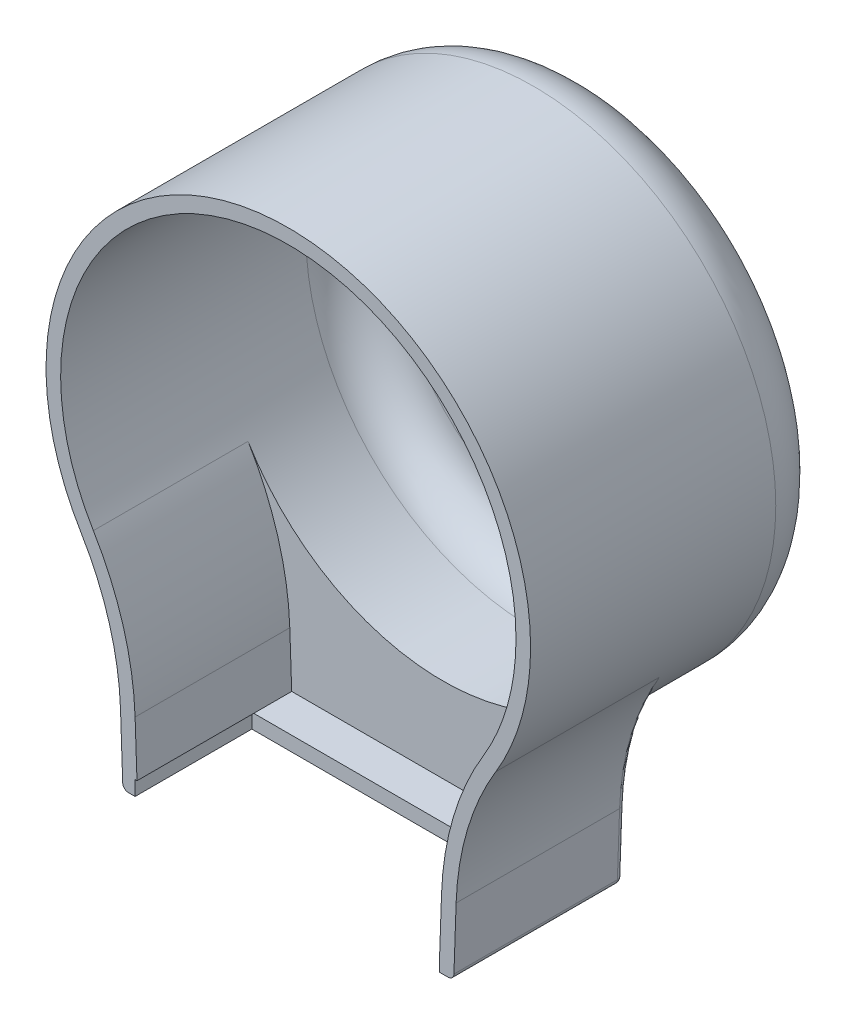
ISO-10303-21;
HEADER;
FILE_DESCRIPTION(('STEP AP214'),'2;1');
FILE_NAME('part.step','',(''),(''),'','','');
FILE_SCHEMA(('AUTOMOTIVE_DESIGN { 1 0 10303 214 1 1 1 1 }'));
ENDSEC;
DATA;
#1=APPLICATION_CONTEXT('core data for automotive mechanical design processes');
#2=APPLICATION_PROTOCOL_DEFINITION('international standard','automotive_design',2000,#1);
#3=PRODUCT_CONTEXT('',#1,'mechanical');
#4=PRODUCT('Part','Part','',(#3));
#5=PRODUCT_RELATED_PRODUCT_CATEGORY('part','',(#4));
#6=PRODUCT_DEFINITION_FORMATION('','',#4);
#7=PRODUCT_DEFINITION_CONTEXT('part definition',#1,'design');
#8=PRODUCT_DEFINITION('design','',#6,#7);
#9=PRODUCT_DEFINITION_SHAPE('','',#8);
#10=(LENGTH_UNIT() NAMED_UNIT(*) SI_UNIT(.MILLI.,.METRE.));
#11=(NAMED_UNIT(*) PLANE_ANGLE_UNIT() SI_UNIT($,.RADIAN.));
#12=(NAMED_UNIT(*) SI_UNIT($,.STERADIAN.) SOLID_ANGLE_UNIT());
#13=UNCERTAINTY_MEASURE_WITH_UNIT(LENGTH_MEASURE(1.E-05),#10,'distance_accuracy_value','');
#14=(GEOMETRIC_REPRESENTATION_CONTEXT(3) GLOBAL_UNCERTAINTY_ASSIGNED_CONTEXT((#13)) GLOBAL_UNIT_ASSIGNED_CONTEXT((#10,
#11,#12)) REPRESENTATION_CONTEXT('',''));
#15=CARTESIAN_POINT('',(0.,0.,0.));
#16=DIRECTION('',(0.,0.,1.));
#17=DIRECTION('',(1.,0.,0.));
#18=AXIS2_PLACEMENT_3D('',#15,#16,#17);
#19=CARTESIAN_POINT('',(-28.7432182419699,-44.3029433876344,-48.));
#20=DIRECTION('',(-0.999390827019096,-0.034899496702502,0.));
#21=DIRECTION('',(0.034899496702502,-0.999390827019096,0.));
#22=AXIS2_PLACEMENT_3D('',#19,#20,#21);
#23=PLANE('',#22);
#24=DIRECTION('',(0.,0.,1.));
#25=VECTOR('',#24,1.);
#26=CARTESIAN_POINT('',(-28.7432182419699,-44.3029433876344,-48.));
#27=LINE('',#26,#25);
#28=CARTESIAN_POINT('',(-28.7432182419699,-44.3029433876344,-24.));
#29=VERTEX_POINT('',#28);
#30=CARTESIAN_POINT('',(-28.7432182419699,-44.3029433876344,4.));
#31=VERTEX_POINT('',#30);
#32=EDGE_CURVE('E286',#29,#31,#27,.T.);
#33=ORIENTED_EDGE('',*,*,#32,.F.);
#34=DIRECTION('',(-0.034899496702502,0.999390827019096,0.));
#35=VECTOR('',#34,1.);
#36=CARTESIAN_POINT('',(-28.7432182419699,-44.3029433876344,-24.));
#37=LINE('',#36,#35);
#38=CARTESIAN_POINT('',(-28.3684500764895,-55.0348994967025,-24.));
#39=VERTEX_POINT('',#38);
#40=EDGE_CURVE('E56',#29,#39,#37,.F.);
#41=ORIENTED_EDGE('',*,*,#40,.T.);
#42=DIRECTION('',(0.,0.,1.));
#43=VECTOR('',#42,1.);
#44=CARTESIAN_POINT('',(-28.3684500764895,-55.0348994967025,-48.));
#45=LINE('',#44,#43);
#46=CARTESIAN_POINT('',(-28.3684500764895,-55.0348994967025,4.));
#47=VERTEX_POINT('',#46);
#48=EDGE_CURVE('E328',#39,#47,#45,.T.);
#49=ORIENTED_EDGE('',*,*,#48,.T.);
#50=DIRECTION('',(0.034899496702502,-0.999390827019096,0.));
#51=VECTOR('',#50,1.);
#52=CARTESIAN_POINT('',(-28.7432182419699,-44.3029433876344,4.));
#53=LINE('',#52,#51);
#54=EDGE_CURVE('E269',#31,#47,#53,.T.);
#55=ORIENTED_EDGE('',*,*,#54,.F.);
#56=EDGE_LOOP('',(#33,#41,#49,#55));
#57=FACE_BOUND('',#56,.T.);
#58=ADVANCED_FACE('F36',(#57),#23,.T.);
#59=CARTESIAN_POINT('',(-76.2142825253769,-45.9606694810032,-48.));
#60=DIRECTION('',(0.,0.,1.));
#61=DIRECTION('',(1.,0.,0.));
#62=AXIS2_PLACEMENT_3D('',#59,#60,#61);
#63=CYLINDRICAL_SURFACE('',#62,47.5);
#64=DIRECTION('',(0.,0.,1.));
#65=VECTOR('',#64,1.);
#66=CARTESIAN_POINT('',(-35.5381205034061,-21.4310986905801,-48.));
#67=LINE('',#66,#65);
#68=CARTESIAN_POINT('',(-35.5381205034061,-21.4310986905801,-24.));
#69=VERTEX_POINT('',#68);
#70=CARTESIAN_POINT('',(-35.5381205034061,-21.4310986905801,4.));
#71=VERTEX_POINT('',#70);
#72=EDGE_CURVE('E289',#69,#71,#67,.T.);
#73=ORIENTED_EDGE('',*,*,#72,.F.);
#74=CARTESIAN_POINT('',(-76.2142825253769,-45.9606694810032,-24.));
#75=DIRECTION('',(0.,0.,-1.));
#76=DIRECTION('',(-1.,0.,0.));
#77=AXIS2_PLACEMENT_3D('',#74,#75,#76);
#78=CIRCLE('',#77,47.5);
#79=EDGE_CURVE('E64',#69,#29,#78,.T.);
#80=ORIENTED_EDGE('',*,*,#79,.T.);
#81=ORIENTED_EDGE('',*,*,#32,.T.);
#82=CARTESIAN_POINT('',(-76.2142825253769,-45.9606694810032,4.));
#83=DIRECTION('',(0.,0.,-1.));
#84=DIRECTION('',(1.,0.,0.));
#85=AXIS2_PLACEMENT_3D('',#82,#83,#84);
#86=CIRCLE('',#85,47.5);
#87=EDGE_CURVE('E282',#71,#31,#86,.T.);
#88=ORIENTED_EDGE('',*,*,#87,.F.);
#89=EDGE_LOOP('',(#73,#80,#81,#88));
#90=FACE_BOUND('',#89,.T.);
#91=ADVANCED_FACE('F437',(#90),#63,.F.);
#92=CARTESIAN_POINT('',(76.2142825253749,-45.9606694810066,-48.));
#93=DIRECTION('',(0.,0.,1.));
#94=DIRECTION('',(1.,0.,0.));
#95=AXIS2_PLACEMENT_3D('',#92,#93,#94);
#96=CYLINDRICAL_SURFACE('',#95,47.5);
#97=DIRECTION('',(0.,0.,1.));
#98=VECTOR('',#97,1.);
#99=CARTESIAN_POINT('',(28.7432182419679,-44.3029433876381,-48.));
#100=LINE('',#99,#98);
#101=CARTESIAN_POINT('',(28.7432182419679,-44.3029433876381,-24.));
#102=VERTEX_POINT('',#101);
#103=CARTESIAN_POINT('',(28.7432182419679,-44.3029433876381,4.));
#104=VERTEX_POINT('',#103);
#105=EDGE_CURVE('E285',#102,#104,#100,.T.);
#106=ORIENTED_EDGE('',*,*,#105,.F.);
#107=CARTESIAN_POINT('',(76.2142825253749,-45.9606694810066,-24.));
#108=DIRECTION('',(0.,0.,-1.));
#109=DIRECTION('',(-1.,0.,0.));
#110=AXIS2_PLACEMENT_3D('',#107,#108,#109);
#111=CIRCLE('',#110,47.5);
#112=CARTESIAN_POINT('',(35.5381205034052,-21.4310986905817,-24.));
#113=VERTEX_POINT('',#112);
#114=EDGE_CURVE('E311',#102,#113,#111,.T.);
#115=ORIENTED_EDGE('',*,*,#114,.T.);
#116=DIRECTION('',(0.,0.,1.));
#117=VECTOR('',#116,1.);
#118=CARTESIAN_POINT('',(35.5381205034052,-21.4310986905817,-48.));
#119=LINE('',#118,#117);
#120=CARTESIAN_POINT('',(35.5381205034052,-21.4310986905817,4.));
#121=VERTEX_POINT('',#120);
#122=EDGE_CURVE('E291',#113,#121,#119,.T.);
#123=ORIENTED_EDGE('',*,*,#122,.T.);
#124=CARTESIAN_POINT('',(76.2142825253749,-45.9606694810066,4.));
#125=DIRECTION('',(0.,0.,-1.));
#126=DIRECTION('',(1.,0.,0.));
#127=AXIS2_PLACEMENT_3D('',#124,#125,#126);
#128=CIRCLE('',#127,47.5);
#129=EDGE_CURVE('E276',#104,#121,#128,.T.);
#130=ORIENTED_EDGE('',*,*,#129,.F.);
#131=EDGE_LOOP('',(#106,#115,#123,#130));
#132=FACE_BOUND('',#131,.T.);
#133=ADVANCED_FACE('F439',(#132),#96,.F.);
#134=CARTESIAN_POINT('',(28.3347480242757,-56.,-48.));
#135=DIRECTION('',(0.999390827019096,-0.0348994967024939,0.));
#136=DIRECTION('',(0.0348994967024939,0.999390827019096,0.));
#137=AXIS2_PLACEMENT_3D('',#134,#135,#136);
#138=PLANE('',#137);
#139=DIRECTION('',(0.,0.,1.));
#140=VECTOR('',#139,1.);
#141=CARTESIAN_POINT('',(28.3684500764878,-55.0348994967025,-48.));
#142=LINE('',#141,#140);
#143=CARTESIAN_POINT('',(28.3684500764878,-55.0348994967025,4.));
#144=VERTEX_POINT('',#143);
#145=CARTESIAN_POINT('',(28.3684500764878,-55.0348994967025,-24.));
#146=VERTEX_POINT('',#145);
#147=EDGE_CURVE('E313',#144,#146,#142,.F.);
#148=ORIENTED_EDGE('',*,*,#147,.T.);
#149=DIRECTION('',(-0.0348994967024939,-0.999390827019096,0.));
#150=VECTOR('',#149,1.);
#151=CARTESIAN_POINT('',(28.3347480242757,-56.,-24.));
#152=LINE('',#151,#150);
#153=EDGE_CURVE('E315',#146,#102,#152,.F.);
#154=ORIENTED_EDGE('',*,*,#153,.T.);
#155=ORIENTED_EDGE('',*,*,#105,.T.);
#156=DIRECTION('',(0.0348994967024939,0.999390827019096,0.));
#157=VECTOR('',#156,1.);
#158=CARTESIAN_POINT('',(28.3347480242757,-56.,4.));
#159=LINE('',#158,#157);
#160=EDGE_CURVE('E274',#144,#104,#159,.T.);
#161=ORIENTED_EDGE('',*,*,#160,.F.);
#162=EDGE_LOOP('',(#148,#154,#155,#161));
#163=FACE_BOUND('',#162,.T.);
#164=ADVANCED_FACE('F444',(#163),#138,.T.);
#165=CARTESIAN_POINT('',(-28.3347480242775,-56.,-48.));
#166=DIRECTION('',(0.,-1.,0.));
#167=DIRECTION('',(1.,0.,0.));
#168=AXIS2_PLACEMENT_3D('',#165,#166,#167);
#169=PLANE('',#168);
#170=DIRECTION('',(-1.,0.,0.));
#171=VECTOR('',#170,1.);
#172=CARTESIAN_POINT('',(-28.3347480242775,-56.,-24.));
#173=LINE('',#172,#171);
#174=CARTESIAN_POINT('',(-27.3690592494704,-56.,-24.));
#175=VERTEX_POINT('',#174);
#176=CARTESIAN_POINT('',(27.3690592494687,-56.,-24.));
#177=VERTEX_POINT('',#176);
#178=EDGE_CURVE('E319',#175,#177,#173,.F.);
#179=ORIENTED_EDGE('',*,*,#178,.T.);
#180=DIRECTION('',(0.,0.,1.));
#181=VECTOR('',#180,1.);
#182=CARTESIAN_POINT('',(27.3690592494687,-56.,-48.));
#183=LINE('',#182,#181);
#184=CARTESIAN_POINT('',(27.3690592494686,-56.,4.));
#185=VERTEX_POINT('',#184);
#186=EDGE_CURVE('E321',#177,#185,#183,.T.);
#187=ORIENTED_EDGE('',*,*,#186,.T.);
#188=DIRECTION('',(1.,0.,0.));
#189=VECTOR('',#188,1.);
#190=CARTESIAN_POINT('',(-28.3347480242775,-56.,4.));
#191=LINE('',#190,#189);
#192=CARTESIAN_POINT('',(25.920526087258,-56.,3.99999999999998));
#193=VERTEX_POINT('',#192);
#194=EDGE_CURVE('E272',#193,#185,#191,.T.);
#195=ORIENTED_EDGE('',*,*,#194,.F.);
#196=DIRECTION('',(0.,0.,-1.));
#197=VECTOR('',#196,1.);
#198=CARTESIAN_POINT('',(25.920526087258,-56.,3.99999999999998));
#199=LINE('',#198,#197);
#200=CARTESIAN_POINT('',(25.920526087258,-56.,-16.));
#201=VERTEX_POINT('',#200);
#202=EDGE_CURVE('E216',#193,#201,#199,.T.);
#203=ORIENTED_EDGE('',*,*,#202,.T.);
#204=DIRECTION('',(-1.,0.,0.));
#205=VECTOR('',#204,1.);
#206=CARTESIAN_POINT('',(-26.2447411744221,-56.,-16.));
#207=LINE('',#206,#205);
#208=CARTESIAN_POINT('',(-26.2447411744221,-56.,-16.));
#209=VERTEX_POINT('',#208);
#210=EDGE_CURVE('E211',#201,#209,#207,.T.);
#211=ORIENTED_EDGE('',*,*,#210,.T.);
#212=DIRECTION('',(0.,0.,1.));
#213=VECTOR('',#212,1.);
#214=CARTESIAN_POINT('',(-26.2447411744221,-56.,3.99999999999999));
#215=LINE('',#214,#213);
#216=CARTESIAN_POINT('',(-26.2447411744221,-56.,3.99999999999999));
#217=VERTEX_POINT('',#216);
#218=EDGE_CURVE('E478',#209,#217,#215,.T.);
#219=ORIENTED_EDGE('',*,*,#218,.T.);
#220=CARTESIAN_POINT('',(-27.3690592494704,-56.,4.));
#221=VERTEX_POINT('',#220);
#222=EDGE_CURVE('E209',#221,#217,#191,.T.);
#223=ORIENTED_EDGE('',*,*,#222,.F.);
#224=DIRECTION('',(0.,0.,1.));
#225=VECTOR('',#224,1.);
#226=CARTESIAN_POINT('',(-27.3690592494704,-56.,-48.));
#227=LINE('',#226,#225);
#228=EDGE_CURVE('E317',#221,#175,#227,.F.);
#229=ORIENTED_EDGE('',*,*,#228,.T.);
#230=EDGE_LOOP('',(#179,#187,#195,#203,#211,#219,#223,#229));
#231=FACE_BOUND('',#230,.T.);
#232=ADVANCED_FACE('F506',(#231),#169,.T.);
#233=CARTESIAN_POINT('',(0.,0.,-48.));
#234=DIRECTION('',(0.,0.,1.));
#235=DIRECTION('',(1.,0.,0.));
#236=AXIS2_PLACEMENT_3D('',#233,#234,#235);
#237=CYLINDRICAL_SURFACE('',#236,41.5);
#238=CARTESIAN_POINT('',(0.,0.,-38.));
#239=DIRECTION('',(0.,0.,1.));
#240=DIRECTION('',(1.,0.,0.));
#241=AXIS2_PLACEMENT_3D('',#238,#239,#240);
#242=CIRCLE('',#241,41.5);
#243=CARTESIAN_POINT('',(41.5,0.,-38.));
#244=VERTEX_POINT('',#243);
#245=EDGE_CURVE('E288',#244,#244,#242,.T.);
#246=ORIENTED_EDGE('',*,*,#245,.T.);
#247=EDGE_LOOP('',(#246));
#248=FACE_BOUND('',#247,.T.);
#249=CARTESIAN_POINT('',(0.,0.,-25.));
#250=DIRECTION('',(0.,0.,1.));
#251=DIRECTION('',(-1.,0.,0.));
#252=AXIS2_PLACEMENT_3D('',#249,#250,#251);
#253=CIRCLE('',#252,41.5);
#254=CARTESIAN_POINT('',(-31.6324148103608,-26.8633641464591,-25.));
#255=VERTEX_POINT('',#254);
#256=CARTESIAN_POINT('',(31.6324148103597,-26.8633641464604,-25.));
#257=VERTEX_POINT('',#256);
#258=EDGE_CURVE('E254',#255,#257,#253,.T.);
#259=ORIENTED_EDGE('',*,*,#258,.F.);
#260=CARTESIAN_POINT('',(-31.6324148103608,-26.8633641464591,-25.));
#261=CARTESIAN_POINT('',(-31.6866088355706,-26.7995491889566,-24.9999961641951));
#262=CARTESIAN_POINT('',(-31.740606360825,-26.7355739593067,-24.9990861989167));
#263=CARTESIAN_POINT('',(-31.8481874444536,-26.6073290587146,-24.9956166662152));
#264=CARTESIAN_POINT('',(-31.9017710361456,-26.5430594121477,-24.9930572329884));
#265=CARTESIAN_POINT('',(-32.0618342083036,-26.3498908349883,-24.9831514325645));
#266=CARTESIAN_POINT('',(-32.1676753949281,-26.220574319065,-24.97357726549));
#267=CARTESIAN_POINT('',(-32.3773658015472,-25.9612008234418,-24.9495248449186));
#268=CARTESIAN_POINT('',(-32.4812183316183,-25.8311456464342,-24.9350556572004));
#269=CARTESIAN_POINT('',(-32.6871132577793,-25.5701049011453,-24.9019976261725));
#270=CARTESIAN_POINT('',(-32.789155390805,-25.4391192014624,-24.8834081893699));
#271=CARTESIAN_POINT('',(-33.0099392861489,-25.1521850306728,-24.839038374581));
#272=CARTESIAN_POINT('',(-33.1283137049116,-24.9960617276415,-24.8125644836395));
#273=CARTESIAN_POINT('',(-33.3625028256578,-24.6826189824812,-24.7556530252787));
#274=CARTESIAN_POINT('',(-33.4783173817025,-24.5252994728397,-24.7252152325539));
#275=CARTESIAN_POINT('',(-33.8219971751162,-24.0515032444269,-24.6290943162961));
#276=CARTESIAN_POINT('',(-34.0460615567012,-23.7332369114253,-24.55861158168));
#277=CARTESIAN_POINT('',(-34.4845121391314,-23.0915478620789,-24.409725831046));
#278=CARTESIAN_POINT('',(-34.6988892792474,-22.7681206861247,-24.3313156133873));
#279=CARTESIAN_POINT('',(-35.1180868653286,-22.1160618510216,-24.1706782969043));
#280=CARTESIAN_POINT('',(-35.3229073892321,-21.7874302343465,-24.0884512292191));
#281=CARTESIAN_POINT('',(-35.5280940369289,-21.4477184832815,-24.0041242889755));
#282=CARTESIAN_POINT('',(-35.5331087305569,-21.4394094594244,-24.0020621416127));
#283=CARTESIAN_POINT('',(-35.5381205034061,-21.4310986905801,-24.));
#284=B_SPLINE_CURVE_WITH_KNOTS('',3,(#260,#261,#262,#263,#264,#265,#266,#267,#268,#269,#270,
#271,#272,#273,#274,#275,#276,#277,#278,#279,#280,#281,#282,#283),.UNSPECIFIED.,.F.,.F.,(4,2,2,
2,2,2,2,2,2,2,2,4),(0.,0.251152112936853,0.502283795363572,1.00431924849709,1.50542995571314,
2.00661289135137,2.59965983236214,3.1927404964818,4.37908518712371,5.56651745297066,
6.75394003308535,6.78370503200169),.UNSPECIFIED.);
#285=EDGE_CURVE('E11',#255,#69,#284,.T.);
#286=ORIENTED_EDGE('',*,*,#285,.T.);
#287=ORIENTED_EDGE('',*,*,#72,.T.);
#288=CARTESIAN_POINT('',(0.,0.,4.));
#289=DIRECTION('',(0.,0.,1.));
#290=DIRECTION('',(1.,0.,0.));
#291=AXIS2_PLACEMENT_3D('',#288,#289,#290);
#292=CIRCLE('',#291,41.5);
#293=EDGE_CURVE('E279',#121,#71,#292,.T.);
#294=ORIENTED_EDGE('',*,*,#293,.F.);
#295=ORIENTED_EDGE('',*,*,#122,.F.);
#296=CARTESIAN_POINT('',(31.6324148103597,-26.8633641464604,-25.));
#297=CARTESIAN_POINT('',(31.6866088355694,-26.7995491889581,-24.9999961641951));
#298=CARTESIAN_POINT('',(31.7406063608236,-26.7355739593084,-24.9990861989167));
#299=CARTESIAN_POINT('',(31.8481874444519,-26.6073290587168,-24.9956166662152));
#300=CARTESIAN_POINT('',(31.9017710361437,-26.5430594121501,-24.9930572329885));
#301=CARTESIAN_POINT('',(32.0618342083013,-26.3498908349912,-24.9831514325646));
#302=CARTESIAN_POINT('',(32.1676753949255,-26.2205743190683,-24.9735772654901));
#303=CARTESIAN_POINT('',(32.3773658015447,-25.9612008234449,-24.9495248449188));
#304=CARTESIAN_POINT('',(32.4812183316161,-25.8311456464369,-24.9350556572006));
#305=CARTESIAN_POINT('',(32.6871132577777,-25.5701049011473,-24.9019976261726));
#306=CARTESIAN_POINT('',(32.7891553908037,-25.4391192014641,-24.88340818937));
#307=CARTESIAN_POINT('',(33.0099392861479,-25.1521850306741,-24.839038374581));
#308=CARTESIAN_POINT('',(33.1283137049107,-24.9960617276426,-24.8125644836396));
#309=CARTESIAN_POINT('',(33.362502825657,-24.6826189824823,-24.7556530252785));
#310=CARTESIAN_POINT('',(33.4783173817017,-24.5252994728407,-24.7252152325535));
#311=CARTESIAN_POINT('',(33.8219971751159,-24.0515032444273,-24.6290943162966));
#312=CARTESIAN_POINT('',(34.0460615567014,-23.7332369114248,-24.558611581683));
#313=CARTESIAN_POINT('',(34.484512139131,-23.0915478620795,-24.4097258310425));
#314=CARTESIAN_POINT('',(34.6988892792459,-22.7681206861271,-24.3313156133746));
#315=CARTESIAN_POINT('',(35.1180868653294,-22.1160618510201,-24.1706782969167));
#316=CARTESIAN_POINT('',(35.3229073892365,-21.7874302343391,-24.0884512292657));
#317=CARTESIAN_POINT('',(35.5280940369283,-21.4477184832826,-24.0041242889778));
#318=CARTESIAN_POINT('',(35.5331087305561,-21.4394094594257,-24.0020621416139));
#319=CARTESIAN_POINT('',(35.5381205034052,-21.4310986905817,-24.));
#320=B_SPLINE_CURVE_WITH_KNOTS('',3,(#296,#297,#298,#299,#300,#301,#302,#303,#304,#305,#306,
#307,#308,#309,#310,#311,#312,#313,#314,#315,#316,#317,#318,#319),.UNSPECIFIED.,.F.,.F.,(4,2,2,
2,2,2,2,2,2,2,2,4),(0.,0.251152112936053,0.502283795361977,1.00431924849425,1.50542995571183,
2.00661289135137,2.59965983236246,3.19274049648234,4.37908518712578,5.56651745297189,
6.75394003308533,6.78370503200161),.UNSPECIFIED.);
#321=EDGE_CURVE('E49',#113,#257,#320,.F.);
#322=ORIENTED_EDGE('',*,*,#321,.T.);
#323=EDGE_LOOP('',(#259,#286,#287,#294,#295,#322));
#324=FACE_BOUND('',#323,.T.);
#325=ADVANCED_FACE('F335',(#248,#324),#237,.T.);
#326=CARTESIAN_POINT('',(76.2142825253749,-45.9606694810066,-48.));
#327=DIRECTION('',(0.,0.,1.));
#328=DIRECTION('',(1.,0.,0.));
#329=AXIS2_PLACEMENT_3D('',#326,#327,#328);
#330=PLANE('',#329);
#331=CARTESIAN_POINT('',(0.,0.,-48.));
#332=DIRECTION('',(0.,0.,1.));
#333=DIRECTION('',(1.,0.,0.));
#334=AXIS2_PLACEMENT_3D('',#331,#332,#333);
#335=CIRCLE('',#334,31.5);
#336=CARTESIAN_POINT('',(31.5,0.,-48.));
#337=VERTEX_POINT('',#336);
#338=EDGE_CURVE('E297',#337,#337,#335,.F.);
#339=ORIENTED_EDGE('',*,*,#338,.T.);
#340=EDGE_LOOP('',(#339));
#341=FACE_BOUND('',#340,.T.);
#342=ADVANCED_FACE('F434',(#341),#330,.F.);
#343=CARTESIAN_POINT('',(76.2142825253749,-45.9606694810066,4.));
#344=DIRECTION('',(0.,0.,1.));
#345=DIRECTION('',(1.,0.,0.));
#346=AXIS2_PLACEMENT_3D('',#343,#344,#345);
#347=PLANE('',#346);
#348=ORIENTED_EDGE('',*,*,#194,.T.);
#349=CARTESIAN_POINT('',(27.3690592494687,-55.,4.));
#350=DIRECTION('',(0.,0.,1.));
#351=DIRECTION('',(1.,0.,0.));
#352=AXIS2_PLACEMENT_3D('',#349,#350,#351);
#353=CIRCLE('',#352,1.);
#354=EDGE_CURVE('E325',#185,#144,#353,.T.);
#355=ORIENTED_EDGE('',*,*,#354,.T.);
#356=ORIENTED_EDGE('',*,*,#160,.T.);
#357=ORIENTED_EDGE('',*,*,#129,.T.);
#358=ORIENTED_EDGE('',*,*,#293,.T.);
#359=ORIENTED_EDGE('',*,*,#87,.T.);
#360=ORIENTED_EDGE('',*,*,#54,.T.);
#361=CARTESIAN_POINT('',(-27.3690592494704,-55.,4.));
#362=DIRECTION('',(0.,0.,1.));
#363=DIRECTION('',(1.,0.,0.));
#364=AXIS2_PLACEMENT_3D('',#361,#362,#363);
#365=CIRCLE('',#364,1.);
#366=EDGE_CURVE('E323',#47,#221,#365,.T.);
#367=ORIENTED_EDGE('',*,*,#366,.T.);
#368=ORIENTED_EDGE('',*,*,#222,.T.);
#369=DIRECTION('',(0.,1.,0.));
#370=VECTOR('',#369,1.);
#371=CARTESIAN_POINT('',(-26.2447411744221,-56.,3.99999999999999));
#372=LINE('',#371,#370);
#373=CARTESIAN_POINT('',(-26.2447411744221,-53.5,3.99999999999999));
#374=VERTEX_POINT('',#373);
#375=EDGE_CURVE('E201',#217,#374,#372,.T.);
#376=ORIENTED_EDGE('',*,*,#375,.T.);
#377=DIRECTION('',(1.,0.,0.));
#378=VECTOR('',#377,1.);
#379=CARTESIAN_POINT('',(-26.2447411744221,-53.5,3.99999999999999));
#380=LINE('',#379,#378);
#381=CARTESIAN_POINT('',(-25.9205260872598,-53.5,3.99999999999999));
#382=VERTEX_POINT('',#381);
#383=EDGE_CURVE('E184',#374,#382,#380,.T.);
#384=ORIENTED_EDGE('',*,*,#383,.T.);
#385=DIRECTION('',(0.034899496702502,-0.999390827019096,0.));
#386=VECTOR('',#385,1.);
#387=CARTESIAN_POINT('',(-26.0590870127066,-49.5321342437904,4.));
#388=LINE('',#387,#386);
#389=CARTESIAN_POINT('',(-26.2447411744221,-44.2156946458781,3.99999999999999));
#390=VERTEX_POINT('',#389);
#391=EDGE_CURVE('E241',#390,#382,#388,.T.);
#392=ORIENTED_EDGE('',*,*,#391,.F.);
#393=CARTESIAN_POINT('',(-76.2142825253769,-45.9606694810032,4.));
#394=DIRECTION('',(0.,0.,1.));
#395=DIRECTION('',(1.,0.,0.));
#396=AXIS2_PLACEMENT_3D('',#393,#394,#395);
#397=CIRCLE('',#396,50.);
#398=CARTESIAN_POINT('',(-33.3972698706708,-20.1400686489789,3.99999999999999));
#399=VERTEX_POINT('',#398);
#400=EDGE_CURVE('E264',#399,#390,#397,.F.);
#401=ORIENTED_EDGE('',*,*,#400,.F.);
#402=CARTESIAN_POINT('',(0.,0.,4.));
#403=DIRECTION('',(0.,0.,1.));
#404=DIRECTION('',(1.,0.,0.));
#405=AXIS2_PLACEMENT_3D('',#402,#403,#404);
#406=CIRCLE('',#405,39.);
#407=CARTESIAN_POINT('',(33.3972698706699,-20.1400686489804,3.99999999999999));
#408=VERTEX_POINT('',#407);
#409=EDGE_CURVE('E262',#408,#399,#406,.T.);
#410=ORIENTED_EDGE('',*,*,#409,.F.);
#411=CARTESIAN_POINT('',(76.2142825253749,-45.9606694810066,4.));
#412=DIRECTION('',(0.,0.,1.));
#413=DIRECTION('',(1.,0.,0.));
#414=AXIS2_PLACEMENT_3D('',#411,#412,#413);
#415=CIRCLE('',#414,50.);
#416=CARTESIAN_POINT('',(26.2447411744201,-44.2156946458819,4.));
#417=VERTEX_POINT('',#416);
#418=EDGE_CURVE('E259',#417,#408,#415,.F.);
#419=ORIENTED_EDGE('',*,*,#418,.F.);
#420=DIRECTION('',(0.0348994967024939,0.999390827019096,0.));
#421=VECTOR('',#420,1.);
#422=CARTESIAN_POINT('',(26.2447411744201,-44.2156946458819,4.));
#423=LINE('',#422,#421);
#424=CARTESIAN_POINT('',(25.920526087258,-53.5,4.));
#425=VERTEX_POINT('',#424);
#426=EDGE_CURVE('E256',#425,#417,#423,.T.);
#427=ORIENTED_EDGE('',*,*,#426,.F.);
#428=DIRECTION('',(0.,1.,0.));
#429=VECTOR('',#428,1.);
#430=CARTESIAN_POINT('',(25.920526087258,-56.,3.99999999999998));
#431=LINE('',#430,#429);
#432=EDGE_CURVE('E210',#193,#425,#431,.T.);
#433=ORIENTED_EDGE('',*,*,#432,.F.);
#434=EDGE_LOOP('',(#348,#355,#356,#357,#358,#359,#360,#367,#368,#376,#384,#392,#401,#410,#419,
#427,#433));
#435=FACE_BOUND('',#434,.T.);
#436=ADVANCED_FACE('F207',(#435),#347,.T.);
#437=CARTESIAN_POINT('',(76.2142825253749,-45.9606694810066,-25.));
#438=DIRECTION('',(0.,0.,-1.));
#439=DIRECTION('',(-1.,0.,0.));
#440=AXIS2_PLACEMENT_3D('',#437,#438,#439);
#441=PLANE('',#440);
#442=ORIENTED_EDGE('',*,*,#258,.T.);
#443=CARTESIAN_POINT('',(76.2142825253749,-45.9606694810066,-25.));
#444=DIRECTION('',(0.,0.,-1.));
#445=DIRECTION('',(-1.,0.,0.));
#446=AXIS2_PLACEMENT_3D('',#443,#444,#445);
#447=CIRCLE('',#446,48.5);
#448=CARTESIAN_POINT('',(27.7438274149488,-44.2680438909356,-25.));
#449=VERTEX_POINT('',#448);
#450=EDGE_CURVE('E308',#257,#449,#447,.F.);
#451=ORIENTED_EDGE('',*,*,#450,.T.);
#452=DIRECTION('',(-0.0348994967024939,-0.999390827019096,0.));
#453=VECTOR('',#452,1.);
#454=CARTESIAN_POINT('',(27.7438274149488,-44.2680438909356,-25.));
#455=LINE('',#454,#453);
#456=CARTESIAN_POINT('',(27.3690592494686,-55.,-25.));
#457=VERTEX_POINT('',#456);
#458=EDGE_CURVE('E306',#449,#457,#455,.T.);
#459=ORIENTED_EDGE('',*,*,#458,.T.);
#460=DIRECTION('',(-1.,0.,0.));
#461=VECTOR('',#460,1.);
#462=CARTESIAN_POINT('',(76.2142825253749,-55.,-25.));
#463=LINE('',#462,#461);
#464=CARTESIAN_POINT('',(-27.3690592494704,-55.,-25.));
#465=VERTEX_POINT('',#464);
#466=EDGE_CURVE('E304',#457,#465,#463,.T.);
#467=ORIENTED_EDGE('',*,*,#466,.T.);
#468=DIRECTION('',(-0.034899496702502,0.999390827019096,0.));
#469=VECTOR('',#468,1.);
#470=CARTESIAN_POINT('',(-27.5581732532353,-49.5844834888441,-25.));
#471=LINE('',#470,#469);
#472=CARTESIAN_POINT('',(-27.7438274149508,-44.2680438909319,-25.));
#473=VERTEX_POINT('',#472);
#474=EDGE_CURVE('E300',#465,#473,#471,.T.);
#475=ORIENTED_EDGE('',*,*,#474,.T.);
#476=CARTESIAN_POINT('',(-76.2142825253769,-45.9606694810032,-25.));
#477=DIRECTION('',(0.,0.,-1.));
#478=DIRECTION('',(-1.,0.,0.));
#479=AXIS2_PLACEMENT_3D('',#476,#477,#478);
#480=CIRCLE('',#479,48.5);
#481=EDGE_CURVE('E302',#473,#255,#480,.F.);
#482=ORIENTED_EDGE('',*,*,#481,.T.);
#483=EDGE_LOOP('',(#442,#451,#459,#467,#475,#482));
#484=FACE_BOUND('',#483,.T.);
#485=ADVANCED_FACE('F427',(#484),#441,.T.);
#486=CARTESIAN_POINT('',(0.,0.,-38.));
#487=DIRECTION('',(0.,0.,1.));
#488=DIRECTION('',(1.,0.,0.));
#489=AXIS2_PLACEMENT_3D('',#486,#487,#488);
#490=TOROIDAL_SURFACE('',#489,31.5,10.);
#491=ORIENTED_EDGE('',*,*,#338,.F.);
#492=EDGE_LOOP('',(#491));
#493=FACE_BOUND('',#492,.T.);
#494=ORIENTED_EDGE('',*,*,#245,.F.);
#495=EDGE_LOOP('',(#494));
#496=FACE_BOUND('',#495,.T.);
#497=ADVANCED_FACE('F393',(#493,#496),#490,.T.);
#498=CARTESIAN_POINT('',(-26.2447411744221,-44.2156946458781,-48.));
#499=DIRECTION('',(-0.999390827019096,-0.034899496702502,0.));
#500=DIRECTION('',(0.034899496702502,-0.999390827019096,0.));
#501=AXIS2_PLACEMENT_3D('',#498,#499,#500);
#502=PLANE('',#501);
#503=DIRECTION('',(0.,0.,1.));
#504=VECTOR('',#503,1.);
#505=CARTESIAN_POINT('',(-26.2447411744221,-44.2156946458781,-48.));
#506=LINE('',#505,#504);
#507=CARTESIAN_POINT('',(-26.2447411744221,-44.2156946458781,-22.5));
#508=VERTEX_POINT('',#507);
#509=EDGE_CURVE('E220',#508,#390,#506,.T.);
#510=ORIENTED_EDGE('',*,*,#509,.T.);
#511=ORIENTED_EDGE('',*,*,#391,.T.);
#512=DIRECTION('',(0.,0.,1.));
#513=VECTOR('',#512,1.);
#514=CARTESIAN_POINT('',(-25.9205260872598,-53.5,-48.));
#515=LINE('',#514,#513);
#516=CARTESIAN_POINT('',(-25.9205260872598,-53.5,-16.));
#517=VERTEX_POINT('',#516);
#518=EDGE_CURVE('E189',#517,#382,#515,.T.);
#519=ORIENTED_EDGE('',*,*,#518,.F.);
#520=CARTESIAN_POINT('',(-25.9205260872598,-53.5,-22.5));
#521=VERTEX_POINT('',#520);
#522=EDGE_CURVE('E228',#521,#517,#515,.T.);
#523=ORIENTED_EDGE('',*,*,#522,.F.);
#524=DIRECTION('',(-0.034899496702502,0.999390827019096,0.));
#525=VECTOR('',#524,1.);
#526=CARTESIAN_POINT('',(-26.0590870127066,-49.5321342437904,-22.5));
#527=LINE('',#526,#525);
#528=EDGE_CURVE('E224',#521,#508,#527,.T.);
#529=ORIENTED_EDGE('',*,*,#528,.T.);
#530=EDGE_LOOP('',(#510,#511,#519,#523,#529));
#531=FACE_BOUND('',#530,.T.);
#532=ADVANCED_FACE('F389',(#531),#502,.F.);
#533=CARTESIAN_POINT('',(-76.2142825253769,-45.9606694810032,-48.));
#534=DIRECTION('',(0.,0.,1.));
#535=DIRECTION('',(1.,0.,0.));
#536=AXIS2_PLACEMENT_3D('',#533,#534,#535);
#537=CYLINDRICAL_SURFACE('',#536,50.);
#538=DIRECTION('',(0.,0.,1.));
#539=VECTOR('',#538,1.);
#540=CARTESIAN_POINT('',(-33.3972698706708,-20.1400686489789,-48.));
#541=LINE('',#540,#539);
#542=CARTESIAN_POINT('',(-33.3972698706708,-20.1400686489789,-22.5));
#543=VERTEX_POINT('',#542);
#544=EDGE_CURVE('E223',#543,#399,#541,.T.);
#545=ORIENTED_EDGE('',*,*,#544,.T.);
#546=ORIENTED_EDGE('',*,*,#400,.T.);
#547=ORIENTED_EDGE('',*,*,#509,.F.);
#548=CARTESIAN_POINT('',(-76.2142825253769,-45.9606694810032,-22.5));
#549=DIRECTION('',(0.,0.,-1.));
#550=DIRECTION('',(-1.,0.,0.));
#551=AXIS2_PLACEMENT_3D('',#548,#549,#550);
#552=CIRCLE('',#551,50.);
#553=EDGE_CURVE('E226',#508,#543,#552,.F.);
#554=ORIENTED_EDGE('',*,*,#553,.T.);
#555=EDGE_LOOP('',(#545,#546,#547,#554));
#556=FACE_BOUND('',#555,.T.);
#557=ADVANCED_FACE('F392',(#556),#537,.T.);
#558=CARTESIAN_POINT('',(76.2142825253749,-45.9606694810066,-48.));
#559=DIRECTION('',(0.,0.,1.));
#560=DIRECTION('',(1.,0.,0.));
#561=AXIS2_PLACEMENT_3D('',#558,#559,#560);
#562=CYLINDRICAL_SURFACE('',#561,50.);
#563=DIRECTION('',(0.,0.,1.));
#564=VECTOR('',#563,1.);
#565=CARTESIAN_POINT('',(26.2447411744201,-44.2156946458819,-48.));
#566=LINE('',#565,#564);
#567=CARTESIAN_POINT('',(26.2447411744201,-44.2156946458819,-22.5));
#568=VERTEX_POINT('',#567);
#569=EDGE_CURVE('E243',#568,#417,#566,.T.);
#570=ORIENTED_EDGE('',*,*,#569,.T.);
#571=ORIENTED_EDGE('',*,*,#418,.T.);
#572=DIRECTION('',(0.,0.,1.));
#573=VECTOR('',#572,1.);
#574=CARTESIAN_POINT('',(33.3972698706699,-20.1400686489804,-48.));
#575=LINE('',#574,#573);
#576=CARTESIAN_POINT('',(33.3972698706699,-20.1400686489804,-22.5));
#577=VERTEX_POINT('',#576);
#578=EDGE_CURVE('E234',#577,#408,#575,.T.);
#579=ORIENTED_EDGE('',*,*,#578,.F.);
#580=CARTESIAN_POINT('',(76.2142825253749,-45.9606694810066,-22.5));
#581=DIRECTION('',(0.,0.,-1.));
#582=DIRECTION('',(-1.,0.,0.));
#583=AXIS2_PLACEMENT_3D('',#580,#581,#582);
#584=CIRCLE('',#583,50.);
#585=EDGE_CURVE('E245',#577,#568,#584,.F.);
#586=ORIENTED_EDGE('',*,*,#585,.T.);
#587=EDGE_LOOP('',(#570,#571,#579,#586));
#588=FACE_BOUND('',#587,.T.);
#589=ADVANCED_FACE('F397',(#588),#562,.T.);
#590=CARTESIAN_POINT('',(25.836270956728,-55.9127512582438,-48.));
#591=DIRECTION('',(0.999390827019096,-0.0348994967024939,0.));
#592=DIRECTION('',(0.0348994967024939,0.999390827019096,0.));
#593=AXIS2_PLACEMENT_3D('',#590,#591,#592);
#594=PLANE('',#593);
#595=DIRECTION('',(0.,0.,1.));
#596=VECTOR('',#595,1.);
#597=CARTESIAN_POINT('',(25.920526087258,-53.5,-48.));
#598=LINE('',#597,#596);
#599=CARTESIAN_POINT('',(25.920526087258,-53.5,-22.5));
#600=VERTEX_POINT('',#599);
#601=CARTESIAN_POINT('',(25.920526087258,-53.5,-16.));
#602=VERTEX_POINT('',#601);
#603=EDGE_CURVE('E231',#600,#602,#598,.T.);
#604=ORIENTED_EDGE('',*,*,#603,.T.);
#605=DIRECTION('',(0.,0.,-1.));
#606=VECTOR('',#605,1.);
#607=CARTESIAN_POINT('',(25.920526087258,-53.5,3.99999999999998));
#608=LINE('',#607,#606);
#609=EDGE_CURVE('E194',#425,#602,#608,.T.);
#610=ORIENTED_EDGE('',*,*,#609,.F.);
#611=ORIENTED_EDGE('',*,*,#426,.T.);
#612=ORIENTED_EDGE('',*,*,#569,.F.);
#613=DIRECTION('',(-0.0348994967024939,-0.999390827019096,0.));
#614=VECTOR('',#613,1.);
#615=CARTESIAN_POINT('',(26.2447411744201,-44.2156946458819,-22.5));
#616=LINE('',#615,#614);
#617=EDGE_CURVE('E247',#568,#600,#616,.T.);
#618=ORIENTED_EDGE('',*,*,#617,.T.);
#619=EDGE_LOOP('',(#604,#610,#611,#612,#618));
#620=FACE_BOUND('',#619,.T.);
#621=ADVANCED_FACE('F401',(#620),#594,.F.);
#622=CARTESIAN_POINT('',(-28.3347480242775,-53.5,-48.));
#623=DIRECTION('',(0.,-1.,0.));
#624=DIRECTION('',(1.,0.,0.));
#625=AXIS2_PLACEMENT_3D('',#622,#623,#624);
#626=PLANE('',#625);
#627=ORIENTED_EDGE('',*,*,#522,.T.);
#628=DIRECTION('',(-1.,0.,0.));
#629=VECTOR('',#628,1.);
#630=CARTESIAN_POINT('',(-26.2447411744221,-53.5,-16.));
#631=LINE('',#630,#629);
#632=EDGE_CURVE('E475',#602,#517,#631,.T.);
#633=ORIENTED_EDGE('',*,*,#632,.F.);
#634=ORIENTED_EDGE('',*,*,#603,.F.);
#635=DIRECTION('',(-1.,0.,0.));
#636=VECTOR('',#635,1.);
#637=CARTESIAN_POINT('',(76.2142825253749,-53.5,-22.5));
#638=LINE('',#637,#636);
#639=EDGE_CURVE('E227',#600,#521,#638,.T.);
#640=ORIENTED_EDGE('',*,*,#639,.T.);
#641=EDGE_LOOP('',(#627,#633,#634,#640));
#642=FACE_BOUND('',#641,.T.);
#643=ADVANCED_FACE('F405',(#642),#626,.F.);
#644=CARTESIAN_POINT('',(0.,0.,-48.));
#645=DIRECTION('',(0.,0.,1.));
#646=DIRECTION('',(1.,0.,0.));
#647=AXIS2_PLACEMENT_3D('',#644,#645,#646);
#648=CYLINDRICAL_SURFACE('',#647,39.);
#649=CARTESIAN_POINT('',(0.,0.,-38.));
#650=DIRECTION('',(0.,0.,1.));
#651=DIRECTION('',(1.,0.,0.));
#652=AXIS2_PLACEMENT_3D('',#649,#650,#651);
#653=CIRCLE('',#652,39.);
#654=CARTESIAN_POINT('',(39.,0.,-38.));
#655=VERTEX_POINT('',#654);
#656=EDGE_CURVE('E222',#655,#655,#653,.T.);
#657=ORIENTED_EDGE('',*,*,#656,.F.);
#658=EDGE_LOOP('',(#657));
#659=FACE_BOUND('',#658,.T.);
#660=CARTESIAN_POINT('',(0.,0.,-22.5));
#661=DIRECTION('',(0.,0.,-1.));
#662=DIRECTION('',(-1.,0.,0.));
#663=AXIS2_PLACEMENT_3D('',#660,#661,#662);
#664=CIRCLE('',#663,39.);
#665=EDGE_CURVE('E236',#543,#577,#664,.F.);
#666=ORIENTED_EDGE('',*,*,#665,.T.);
#667=ORIENTED_EDGE('',*,*,#578,.T.);
#668=ORIENTED_EDGE('',*,*,#409,.T.);
#669=ORIENTED_EDGE('',*,*,#544,.F.);
#670=EDGE_LOOP('',(#666,#667,#668,#669));
#671=FACE_BOUND('',#670,.T.);
#672=ADVANCED_FACE('F409',(#659,#671),#648,.F.);
#673=CARTESIAN_POINT('',(76.2142825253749,-45.9606694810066,-45.5));
#674=DIRECTION('',(0.,0.,1.));
#675=DIRECTION('',(1.,0.,0.));
#676=AXIS2_PLACEMENT_3D('',#673,#674,#675);
#677=PLANE('',#676);
#678=CARTESIAN_POINT('',(0.,0.,-45.5));
#679=DIRECTION('',(0.,0.,1.));
#680=DIRECTION('',(1.,0.,0.));
#681=AXIS2_PLACEMENT_3D('',#678,#679,#680);
#682=CIRCLE('',#681,31.5);
#683=CARTESIAN_POINT('',(31.5,0.,-45.5));
#684=VERTEX_POINT('',#683);
#685=EDGE_CURVE('E239',#684,#684,#682,.F.);
#686=ORIENTED_EDGE('',*,*,#685,.F.);
#687=EDGE_LOOP('',(#686));
#688=FACE_BOUND('',#687,.T.);
#689=ADVANCED_FACE('F413',(#688),#677,.T.);
#690=CARTESIAN_POINT('',(76.2142825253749,-45.9606694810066,-22.5));
#691=DIRECTION('',(0.,0.,-1.));
#692=DIRECTION('',(-1.,0.,0.));
#693=AXIS2_PLACEMENT_3D('',#690,#691,#692);
#694=PLANE('',#693);
#695=ORIENTED_EDGE('',*,*,#585,.F.);
#696=ORIENTED_EDGE('',*,*,#665,.F.);
#697=ORIENTED_EDGE('',*,*,#553,.F.);
#698=ORIENTED_EDGE('',*,*,#528,.F.);
#699=ORIENTED_EDGE('',*,*,#639,.F.);
#700=ORIENTED_EDGE('',*,*,#617,.F.);
#701=EDGE_LOOP('',(#695,#696,#697,#698,#699,#700));
#702=FACE_BOUND('',#701,.T.);
#703=ADVANCED_FACE('F417',(#702),#694,.F.);
#704=CARTESIAN_POINT('',(0.,0.,-38.));
#705=DIRECTION('',(0.,0.,1.));
#706=DIRECTION('',(1.,0.,0.));
#707=AXIS2_PLACEMENT_3D('',#704,#705,#706);
#708=TOROIDAL_SURFACE('',#707,31.5,7.5);
#709=ORIENTED_EDGE('',*,*,#685,.T.);
#710=EDGE_LOOP('',(#709));
#711=FACE_BOUND('',#710,.T.);
#712=ORIENTED_EDGE('',*,*,#656,.T.);
#713=EDGE_LOOP('',(#712));
#714=FACE_BOUND('',#713,.T.);
#715=ADVANCED_FACE('F379',(#711,#714),#708,.F.);
#716=CARTESIAN_POINT('',(-26.2447411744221,-53.5,-16.));
#717=DIRECTION('',(0.,-1.,0.));
#718=DIRECTION('',(1.,0.,0.));
#719=AXIS2_PLACEMENT_3D('',#716,#717,#718);
#720=PLANE('',#719);
#721=ORIENTED_EDGE('',*,*,#518,.T.);
#722=ORIENTED_EDGE('',*,*,#383,.F.);
#723=DIRECTION('',(0.,0.,1.));
#724=VECTOR('',#723,1.);
#725=CARTESIAN_POINT('',(-26.2447411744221,-53.5,3.99999999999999));
#726=LINE('',#725,#724);
#727=CARTESIAN_POINT('',(-26.2447411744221,-53.5,-16.));
#728=VERTEX_POINT('',#727);
#729=EDGE_CURVE('E187',#728,#374,#726,.T.);
#730=ORIENTED_EDGE('',*,*,#729,.F.);
#731=EDGE_CURVE('E474',#517,#728,#631,.T.);
#732=ORIENTED_EDGE('',*,*,#731,.F.);
#733=EDGE_LOOP('',(#721,#722,#730,#732));
#734=FACE_BOUND('',#733,.T.);
#735=ADVANCED_FACE('F186',(#734),#720,.T.);
#736=CARTESIAN_POINT('',(-26.2447411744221,-56.,3.99999999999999));
#737=DIRECTION('',(-1.,0.,0.));
#738=DIRECTION('',(0.,-1.,0.));
#739=AXIS2_PLACEMENT_3D('',#736,#737,#738);
#740=PLANE('',#739);
#741=ORIENTED_EDGE('',*,*,#729,.T.);
#742=ORIENTED_EDGE('',*,*,#375,.F.);
#743=ORIENTED_EDGE('',*,*,#218,.F.);
#744=DIRECTION('',(0.,1.,0.));
#745=VECTOR('',#744,1.);
#746=CARTESIAN_POINT('',(-26.2447411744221,-56.,-16.));
#747=LINE('',#746,#745);
#748=EDGE_CURVE('E203',#209,#728,#747,.T.);
#749=ORIENTED_EDGE('',*,*,#748,.T.);
#750=EDGE_LOOP('',(#741,#742,#743,#749));
#751=FACE_BOUND('',#750,.T.);
#752=ADVANCED_FACE('F199',(#751),#740,.F.);
#753=CARTESIAN_POINT('',(-26.2447411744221,-56.,-16.));
#754=DIRECTION('',(0.,0.,-1.));
#755=DIRECTION('',(-1.,0.,0.));
#756=AXIS2_PLACEMENT_3D('',#753,#754,#755);
#757=PLANE('',#756);
#758=ORIENTED_EDGE('',*,*,#632,.T.);
#759=ORIENTED_EDGE('',*,*,#731,.T.);
#760=ORIENTED_EDGE('',*,*,#748,.F.);
#761=ORIENTED_EDGE('',*,*,#210,.F.);
#762=DIRECTION('',(0.,1.,0.));
#763=VECTOR('',#762,1.);
#764=CARTESIAN_POINT('',(25.920526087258,-56.,-16.));
#765=LINE('',#764,#763);
#766=EDGE_CURVE('E213',#201,#602,#765,.T.);
#767=ORIENTED_EDGE('',*,*,#766,.T.);
#768=EDGE_LOOP('',(#758,#759,#760,#761,#767));
#769=FACE_BOUND('',#768,.T.);
#770=ADVANCED_FACE('F380',(#769),#757,.F.);
#771=CARTESIAN_POINT('',(25.920526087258,-56.,3.99999999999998));
#772=DIRECTION('',(1.,0.,0.));
#773=DIRECTION('',(0.,1.,0.));
#774=AXIS2_PLACEMENT_3D('',#771,#772,#773);
#775=PLANE('',#774);
#776=ORIENTED_EDGE('',*,*,#609,.T.);
#777=ORIENTED_EDGE('',*,*,#766,.F.);
#778=ORIENTED_EDGE('',*,*,#202,.F.);
#779=ORIENTED_EDGE('',*,*,#432,.T.);
#780=EDGE_LOOP('',(#776,#777,#778,#779));
#781=FACE_BOUND('',#780,.T.);
#782=ADVANCED_FACE('F375',(#781),#775,.F.);
#783=CARTESIAN_POINT('',(-76.2142825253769,-45.9606694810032,-24.));
#784=DIRECTION('',(0.,0.,-1.));
#785=DIRECTION('',(-1.,0.,0.));
#786=AXIS2_PLACEMENT_3D('',#783,#784,#785);
#787=TOROIDAL_SURFACE('',#786,48.5,1.);
#788=ORIENTED_EDGE('',*,*,#285,.F.);
#789=ORIENTED_EDGE('',*,*,#481,.F.);
#790=CARTESIAN_POINT('',(-27.7438274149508,-44.2680438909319,-24.));
#791=DIRECTION('',(0.0348994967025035,-0.999390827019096,0.));
#792=DIRECTION('',(0.999390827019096,0.0348994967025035,0.));
#793=AXIS2_PLACEMENT_3D('',#790,#791,#792);
#794=CIRCLE('',#793,1.);
#795=EDGE_CURVE('E204',#29,#473,#794,.T.);
#796=ORIENTED_EDGE('',*,*,#795,.F.);
#797=ORIENTED_EDGE('',*,*,#79,.F.);
#798=EDGE_LOOP('',(#788,#789,#796,#797));
#799=FACE_BOUND('',#798,.T.);
#800=ADVANCED_FACE('F370',(#799),#787,.T.);
#801=CARTESIAN_POINT('',(-27.5581732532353,-49.5844834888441,-24.));
#802=DIRECTION('',(-0.034899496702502,0.999390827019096,0.));
#803=DIRECTION('',(-0.999390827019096,-0.034899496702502,0.));
#804=AXIS2_PLACEMENT_3D('',#801,#802,#803);
#805=CYLINDRICAL_SURFACE('',#804,1.);
#806=ORIENTED_EDGE('',*,*,#795,.T.);
#807=ORIENTED_EDGE('',*,*,#474,.F.);
#808=CARTESIAN_POINT('',(-27.3690592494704,-55.,-24.));
#809=DIRECTION('',(0.0348994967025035,-0.999390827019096,0.));
#810=DIRECTION('',(0.999390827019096,0.0348994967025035,0.));
#811=AXIS2_PLACEMENT_3D('',#808,#809,#810);
#812=CIRCLE('',#811,1.);
#813=EDGE_CURVE('E454',#39,#465,#812,.T.);
#814=ORIENTED_EDGE('',*,*,#813,.F.);
#815=ORIENTED_EDGE('',*,*,#40,.F.);
#816=EDGE_LOOP('',(#806,#807,#814,#815));
#817=FACE_BOUND('',#816,.T.);
#818=ADVANCED_FACE('F367',(#817),#805,.T.);
#819=CARTESIAN_POINT('',(-27.3690592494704,-55.,-48.));
#820=DIRECTION('',(0.,0.,1.));
#821=DIRECTION('',(1.,0.,0.));
#822=AXIS2_PLACEMENT_3D('',#819,#820,#821);
#823=CYLINDRICAL_SURFACE('',#822,1.);
#824=ORIENTED_EDGE('',*,*,#366,.F.);
#825=ORIENTED_EDGE('',*,*,#48,.F.);
#826=CARTESIAN_POINT('',(-27.3690592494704,-55.,-24.));
#827=DIRECTION('',(0.,0.,-1.));
#828=DIRECTION('',(-1.,0.,0.));
#829=AXIS2_PLACEMENT_3D('',#826,#827,#828);
#830=CIRCLE('',#829,1.);
#831=EDGE_CURVE('E461',#175,#39,#830,.T.);
#832=ORIENTED_EDGE('',*,*,#831,.F.);
#833=ORIENTED_EDGE('',*,*,#228,.F.);
#834=EDGE_LOOP('',(#824,#825,#832,#833));
#835=FACE_BOUND('',#834,.T.);
#836=ADVANCED_FACE('F363',(#835),#823,.T.);
#837=CARTESIAN_POINT('',(-27.3690592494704,-55.,-24.));
#838=DIRECTION('',(0.,0.,1.));
#839=DIRECTION('',(1.,0.,0.));
#840=AXIS2_PLACEMENT_3D('',#837,#838,#839);
#841=SPHERICAL_SURFACE('',#840,1.);
#842=ORIENTED_EDGE('',*,*,#831,.T.);
#843=ORIENTED_EDGE('',*,*,#813,.T.);
#844=CARTESIAN_POINT('',(-27.3690592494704,-55.,-24.));
#845=DIRECTION('',(-1.,0.,0.));
#846=DIRECTION('',(0.,-1.,0.));
#847=AXIS2_PLACEMENT_3D('',#844,#845,#846);
#848=CIRCLE('',#847,1.);
#849=EDGE_CURVE('E464',#175,#465,#848,.F.);
#850=ORIENTED_EDGE('',*,*,#849,.F.);
#851=EDGE_LOOP('',(#842,#843,#850));
#852=FACE_BOUND('',#851,.T.);
#853=ADVANCED_FACE('F359',(#852),#841,.T.);
#854=CARTESIAN_POINT('',(76.2142825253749,-55.,-24.));
#855=DIRECTION('',(-1.,0.,0.));
#856=DIRECTION('',(0.,-1.,0.));
#857=AXIS2_PLACEMENT_3D('',#854,#855,#856);
#858=CYLINDRICAL_SURFACE('',#857,1.);
#859=ORIENTED_EDGE('',*,*,#849,.T.);
#860=ORIENTED_EDGE('',*,*,#466,.F.);
#861=CARTESIAN_POINT('',(27.3690592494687,-55.,-24.));
#862=DIRECTION('',(1.,0.,0.));
#863=DIRECTION('',(0.,0.,-1.));
#864=AXIS2_PLACEMENT_3D('',#861,#862,#863);
#865=CIRCLE('',#864,1.);
#866=EDGE_CURVE('E468',#177,#457,#865,.T.);
#867=ORIENTED_EDGE('',*,*,#866,.F.);
#868=ORIENTED_EDGE('',*,*,#178,.F.);
#869=EDGE_LOOP('',(#859,#860,#867,#868));
#870=FACE_BOUND('',#869,.T.);
#871=ADVANCED_FACE('F355',(#870),#858,.T.);
#872=CARTESIAN_POINT('',(27.3690592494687,-55.,-48.));
#873=DIRECTION('',(0.,0.,1.));
#874=DIRECTION('',(1.,0.,0.));
#875=AXIS2_PLACEMENT_3D('',#872,#873,#874);
#876=CYLINDRICAL_SURFACE('',#875,1.);
#877=ORIENTED_EDGE('',*,*,#354,.F.);
#878=ORIENTED_EDGE('',*,*,#186,.F.);
#879=CARTESIAN_POINT('',(27.3690592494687,-55.,-24.));
#880=DIRECTION('',(0.,0.,-1.));
#881=DIRECTION('',(-1.,0.,0.));
#882=AXIS2_PLACEMENT_3D('',#879,#880,#881);
#883=CIRCLE('',#882,1.);
#884=EDGE_CURVE('E512',#146,#177,#883,.T.);
#885=ORIENTED_EDGE('',*,*,#884,.F.);
#886=ORIENTED_EDGE('',*,*,#147,.F.);
#887=EDGE_LOOP('',(#877,#878,#885,#886));
#888=FACE_BOUND('',#887,.T.);
#889=ADVANCED_FACE('F351',(#888),#876,.T.);
#890=CARTESIAN_POINT('',(27.3690592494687,-55.,-24.));
#891=DIRECTION('',(0.,0.,1.));
#892=DIRECTION('',(1.,0.,0.));
#893=AXIS2_PLACEMENT_3D('',#890,#891,#892);
#894=SPHERICAL_SURFACE('',#893,1.);
#895=ORIENTED_EDGE('',*,*,#884,.T.);
#896=ORIENTED_EDGE('',*,*,#866,.T.);
#897=CARTESIAN_POINT('',(27.3690592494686,-55.,-24.));
#898=DIRECTION('',(-0.0348994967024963,-0.999390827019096,0.));
#899=DIRECTION('',(0.999390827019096,-0.0348994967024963,0.));
#900=AXIS2_PLACEMENT_3D('',#897,#898,#899);
#901=CIRCLE('',#900,1.);
#902=EDGE_CURVE('E517',#146,#457,#901,.F.);
#903=ORIENTED_EDGE('',*,*,#902,.F.);
#904=EDGE_LOOP('',(#895,#896,#903));
#905=FACE_BOUND('',#904,.T.);
#906=ADVANCED_FACE('F347',(#905),#894,.T.);
#907=CARTESIAN_POINT('',(27.7438274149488,-44.2680438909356,-24.));
#908=DIRECTION('',(-0.0348994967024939,-0.999390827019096,0.));
#909=DIRECTION('',(0.999390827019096,-0.0348994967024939,0.));
#910=AXIS2_PLACEMENT_3D('',#907,#908,#909);
#911=CYLINDRICAL_SURFACE('',#910,1.);
#912=ORIENTED_EDGE('',*,*,#902,.T.);
#913=ORIENTED_EDGE('',*,*,#458,.F.);
#914=CARTESIAN_POINT('',(27.7438274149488,-44.2680438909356,-24.));
#915=DIRECTION('',(0.0348994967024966,0.999390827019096,0.));
#916=DIRECTION('',(-0.999390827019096,0.0348994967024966,0.));
#917=AXIS2_PLACEMENT_3D('',#914,#915,#916);
#918=CIRCLE('',#917,1.);
#919=EDGE_CURVE('E520',#102,#449,#918,.T.);
#920=ORIENTED_EDGE('',*,*,#919,.F.);
#921=ORIENTED_EDGE('',*,*,#153,.F.);
#922=EDGE_LOOP('',(#912,#913,#920,#921));
#923=FACE_BOUND('',#922,.T.);
#924=ADVANCED_FACE('F343',(#923),#911,.T.);
#925=CARTESIAN_POINT('',(76.2142825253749,-45.9606694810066,-24.));
#926=DIRECTION('',(0.,0.,-1.));
#927=DIRECTION('',(-1.,0.,0.));
#928=AXIS2_PLACEMENT_3D('',#925,#926,#927);
#929=TOROIDAL_SURFACE('',#928,48.5,1.);
#930=ORIENTED_EDGE('',*,*,#321,.F.);
#931=ORIENTED_EDGE('',*,*,#114,.F.);
#932=ORIENTED_EDGE('',*,*,#919,.T.);
#933=ORIENTED_EDGE('',*,*,#450,.F.);
#934=EDGE_LOOP('',(#930,#931,#932,#933));
#935=FACE_BOUND('',#934,.T.);
#936=ADVANCED_FACE('F339',(#935),#929,.T.);
#937=CLOSED_SHELL('',(#58,#91,#133,#164,#232,#325,#342,#436,#485,#497,#532,#557,#589,#621,#643,
#672,#689,#703,#715,#735,#752,#770,#782,#800,#818,#836,#853,#871,#889,#906,#924,#936));
#938=MANIFOLD_SOLID_BREP('B2',#937);
#939=ADVANCED_BREP_SHAPE_REPRESENTATION('',(#18,#938),#14);
#940=SHAPE_DEFINITION_REPRESENTATION(#9,#939);
ENDSEC;
END-ISO-10303-21;
